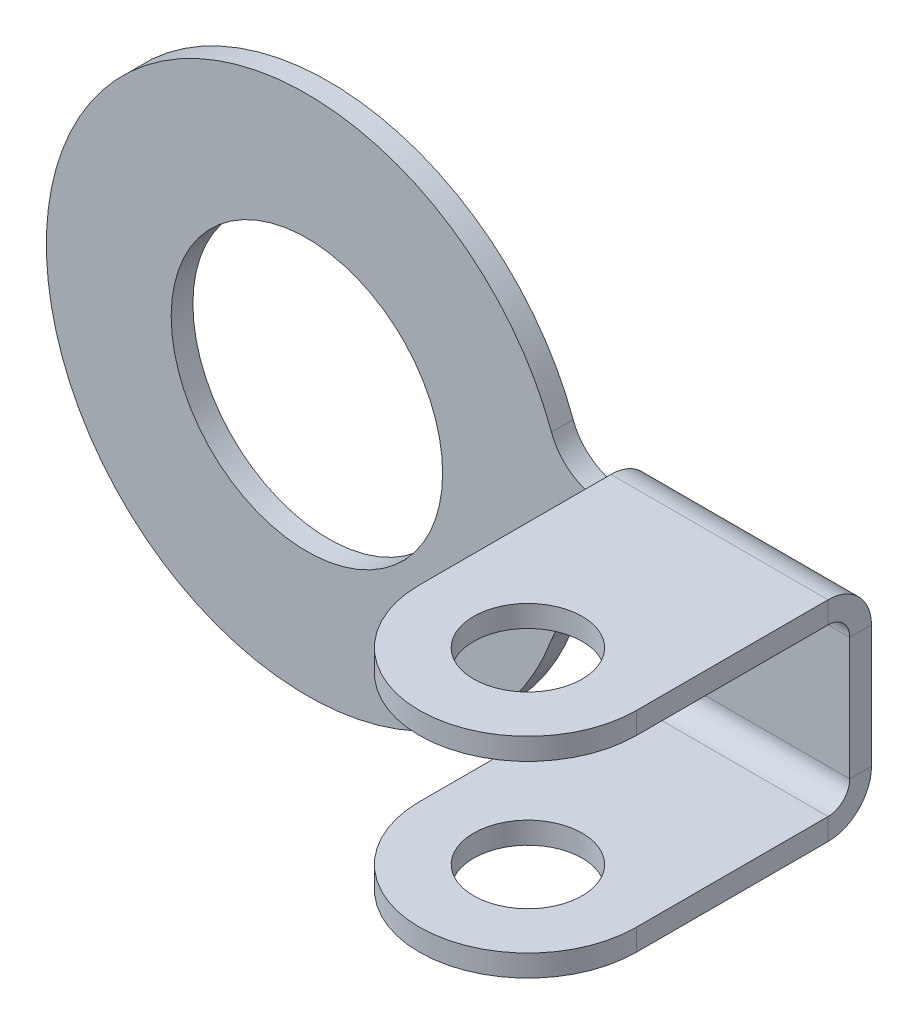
ISO-10303-21;
HEADER;
FILE_DESCRIPTION(('STEP AP214'),'2;1');
FILE_NAME('part.step','',(''),(''),'','','');
FILE_SCHEMA(('AUTOMOTIVE_DESIGN { 1 0 10303 214 1 1 1 1 }'));
ENDSEC;
DATA;
#1=APPLICATION_CONTEXT('core data for automotive mechanical design processes');
#2=APPLICATION_PROTOCOL_DEFINITION('international standard','automotive_design',2000,#1);
#3=PRODUCT_CONTEXT('',#1,'mechanical');
#4=PRODUCT('Part','Part','',(#3));
#5=PRODUCT_RELATED_PRODUCT_CATEGORY('part','',(#4));
#6=PRODUCT_DEFINITION_FORMATION('','',#4);
#7=PRODUCT_DEFINITION_CONTEXT('part definition',#1,'design');
#8=PRODUCT_DEFINITION('design','',#6,#7);
#9=PRODUCT_DEFINITION_SHAPE('','',#8);
#10=(LENGTH_UNIT() NAMED_UNIT(*) SI_UNIT(.MILLI.,.METRE.));
#11=(NAMED_UNIT(*) PLANE_ANGLE_UNIT() SI_UNIT($,.RADIAN.));
#12=(NAMED_UNIT(*) SI_UNIT($,.STERADIAN.) SOLID_ANGLE_UNIT());
#13=UNCERTAINTY_MEASURE_WITH_UNIT(LENGTH_MEASURE(1.E-05),#10,'distance_accuracy_value','');
#14=(GEOMETRIC_REPRESENTATION_CONTEXT(3) GLOBAL_UNCERTAINTY_ASSIGNED_CONTEXT((#13)) GLOBAL_UNIT_ASSIGNED_CONTEXT((#10,
#11,#12)) REPRESENTATION_CONTEXT('',''));
#15=CARTESIAN_POINT('',(0.,0.,0.));
#16=DIRECTION('',(0.,0.,1.));
#17=DIRECTION('',(1.,0.,0.));
#18=AXIS2_PLACEMENT_3D('',#15,#16,#17);
#19=CARTESIAN_POINT('',(17.2213151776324,15.3561944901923,-18.3561944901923));
#20=DIRECTION('',(0.,1.,0.));
#21=DIRECTION('',(1.,0.,0.));
#22=AXIS2_PLACEMENT_3D('',#19,#20,#21);
#23=PLANE('',#22);
#24=CARTESIAN_POINT('',(30.,15.3561944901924,19.6438055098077));
#25=DIRECTION('',(0.,1.,0.));
#26=DIRECTION('',(-1.,0.,0.));
#27=AXIS2_PLACEMENT_3D('',#24,#25,#26);
#28=CIRCLE('',#27,5.);
#29=CARTESIAN_POINT('',(25.,15.3561944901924,19.6438055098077));
#30=VERTEX_POINT('',#29);
#31=EDGE_CURVE('E112',#30,#30,#28,.T.);
#32=ORIENTED_EDGE('',*,*,#31,.F.);
#33=EDGE_LOOP('',(#32));
#34=FACE_BOUND('',#33,.T.);
#35=DIRECTION('',(0.,0.,-1.));
#36=VECTOR('',#35,1.);
#37=CARTESIAN_POINT('',(40.,15.3561944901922,-36.3561944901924));
#38=LINE('',#37,#36);
#39=CARTESIAN_POINT('',(40.,15.3561944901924,19.6438055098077));
#40=VERTEX_POINT('',#39);
#41=CARTESIAN_POINT('',(39.9999999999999,15.3561944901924,2.));
#42=VERTEX_POINT('',#41);
#43=EDGE_CURVE('E78',#40,#42,#38,.T.);
#44=ORIENTED_EDGE('',*,*,#43,.T.);
#45=DIRECTION('',(-1.,0.,0.));
#46=VECTOR('',#45,1.);
#47=CARTESIAN_POINT('',(17.2213151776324,15.3561944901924,2.00000000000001));
#48=LINE('',#47,#46);
#49=CARTESIAN_POINT('',(20.,15.3561944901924,2.00000000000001));
#50=VERTEX_POINT('',#49);
#51=EDGE_CURVE('E11',#42,#50,#48,.T.);
#52=ORIENTED_EDGE('',*,*,#51,.T.);
#53=DIRECTION('',(0.,0.,1.));
#54=VECTOR('',#53,1.);
#55=CARTESIAN_POINT('',(20.,15.3561944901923,-2.35619449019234));
#56=LINE('',#55,#54);
#57=CARTESIAN_POINT('',(20.,15.3561944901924,19.6438055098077));
#58=VERTEX_POINT('',#57);
#59=EDGE_CURVE('E87',#50,#58,#56,.T.);
#60=ORIENTED_EDGE('',*,*,#59,.T.);
#61=CARTESIAN_POINT('',(30.,15.3561944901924,19.6438055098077));
#62=DIRECTION('',(0.,1.,0.));
#63=DIRECTION('',(1.,0.,0.));
#64=AXIS2_PLACEMENT_3D('',#61,#62,#63);
#65=CIRCLE('',#64,10.);
#66=EDGE_CURVE('E71',#58,#40,#65,.T.);
#67=ORIENTED_EDGE('',*,*,#66,.T.);
#68=EDGE_LOOP('',(#44,#52,#60,#67));
#69=FACE_BOUND('',#68,.T.);
#70=ADVANCED_FACE('F31',(#34,#69),#23,.T.);
#71=CARTESIAN_POINT('',(20.,13.3561944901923,-2.35619449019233));
#72=DIRECTION('',(-1.,0.,0.));
#73=DIRECTION('',(0.,1.,0.));
#74=AXIS2_PLACEMENT_3D('',#71,#72,#73);
#75=PLANE('',#74);
#76=ORIENTED_EDGE('',*,*,#59,.F.);
#77=DIRECTION('',(0.,-1.,0.));
#78=VECTOR('',#77,1.);
#79=CARTESIAN_POINT('',(20.,13.3561944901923,2.));
#80=LINE('',#79,#78);
#81=CARTESIAN_POINT('',(20.,13.3561944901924,2.00000000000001));
#82=VERTEX_POINT('',#81);
#83=EDGE_CURVE('E39',#50,#82,#80,.T.);
#84=ORIENTED_EDGE('',*,*,#83,.T.);
#85=DIRECTION('',(0.,0.,1.));
#86=VECTOR('',#85,1.);
#87=CARTESIAN_POINT('',(20.,13.3561944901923,-2.35619449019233));
#88=LINE('',#87,#86);
#89=CARTESIAN_POINT('',(20.,13.3561944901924,19.6438055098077));
#90=VERTEX_POINT('',#89);
#91=EDGE_CURVE('E84',#82,#90,#88,.T.);
#92=ORIENTED_EDGE('',*,*,#91,.T.);
#93=DIRECTION('',(0.,1.,0.));
#94=VECTOR('',#93,1.);
#95=CARTESIAN_POINT('',(20.,13.3561944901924,19.6438055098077));
#96=LINE('',#95,#94);
#97=EDGE_CURVE('E74',#90,#58,#96,.T.);
#98=ORIENTED_EDGE('',*,*,#97,.T.);
#99=EDGE_LOOP('',(#76,#84,#92,#98));
#100=FACE_BOUND('',#99,.T.);
#101=ADVANCED_FACE('F33',(#100),#75,.T.);
#102=CARTESIAN_POINT('',(40.,13.3561944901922,-36.3561944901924));
#103=DIRECTION('',(1.,0.,0.));
#104=DIRECTION('',(0.,-1.,0.));
#105=AXIS2_PLACEMENT_3D('',#102,#103,#104);
#106=PLANE('',#105);
#107=DIRECTION('',(0.,0.,-1.));
#108=VECTOR('',#107,1.);
#109=CARTESIAN_POINT('',(40.,13.3561944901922,-36.3561944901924));
#110=LINE('',#109,#108);
#111=CARTESIAN_POINT('',(40.,13.3561944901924,19.6438055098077));
#112=VERTEX_POINT('',#111);
#113=CARTESIAN_POINT('',(39.9999999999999,13.3561944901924,2.00000000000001));
#114=VERTEX_POINT('',#113);
#115=EDGE_CURVE('E95',#112,#114,#110,.T.);
#116=ORIENTED_EDGE('',*,*,#115,.T.);
#117=DIRECTION('',(0.,1.,0.));
#118=VECTOR('',#117,1.);
#119=CARTESIAN_POINT('',(40.,13.3561944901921,2.));
#120=LINE('',#119,#118);
#121=EDGE_CURVE('E82',#114,#42,#120,.T.);
#122=ORIENTED_EDGE('',*,*,#121,.T.);
#123=ORIENTED_EDGE('',*,*,#43,.F.);
#124=DIRECTION('',(0.,1.,0.));
#125=VECTOR('',#124,1.);
#126=CARTESIAN_POINT('',(40.,13.3561944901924,19.6438055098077));
#127=LINE('',#126,#125);
#128=EDGE_CURVE('E55',#112,#40,#127,.T.);
#129=ORIENTED_EDGE('',*,*,#128,.F.);
#130=EDGE_LOOP('',(#116,#122,#123,#129));
#131=FACE_BOUND('',#130,.T.);
#132=ADVANCED_FACE('F79',(#131),#106,.T.);
#133=CARTESIAN_POINT('',(17.2213151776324,13.3561944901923,-18.3561944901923));
#134=DIRECTION('',(0.,1.,0.));
#135=DIRECTION('',(1.,0.,0.));
#136=AXIS2_PLACEMENT_3D('',#133,#134,#135);
#137=PLANE('',#136);
#138=DIRECTION('',(-1.,0.,0.));
#139=VECTOR('',#138,1.);
#140=CARTESIAN_POINT('',(17.2213151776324,13.3561944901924,2.));
#141=LINE('',#140,#139);
#142=EDGE_CURVE('E46',#114,#82,#141,.T.);
#143=ORIENTED_EDGE('',*,*,#142,.F.);
#144=ORIENTED_EDGE('',*,*,#115,.F.);
#145=CARTESIAN_POINT('',(30.,13.3561944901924,19.6438055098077));
#146=DIRECTION('',(0.,1.,0.));
#147=DIRECTION('',(1.,0.,0.));
#148=AXIS2_PLACEMENT_3D('',#145,#146,#147);
#149=CIRCLE('',#148,10.);
#150=EDGE_CURVE('E73',#90,#112,#149,.T.);
#151=ORIENTED_EDGE('',*,*,#150,.F.);
#152=ORIENTED_EDGE('',*,*,#91,.F.);
#153=EDGE_LOOP('',(#143,#144,#151,#152));
#154=FACE_BOUND('',#153,.T.);
#155=CARTESIAN_POINT('',(30.,13.3561944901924,19.6438055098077));
#156=DIRECTION('',(0.,1.,0.));
#157=DIRECTION('',(-1.,0.,0.));
#158=AXIS2_PLACEMENT_3D('',#155,#156,#157);
#159=CIRCLE('',#158,5.);
#160=CARTESIAN_POINT('',(25.,13.3561944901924,19.6438055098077));
#161=VERTEX_POINT('',#160);
#162=EDGE_CURVE('E90',#161,#161,#159,.T.);
#163=ORIENTED_EDGE('',*,*,#162,.T.);
#164=EDGE_LOOP('',(#163));
#165=FACE_BOUND('',#164,.T.);
#166=ADVANCED_FACE('F106',(#154,#165),#137,.F.);
#167=CARTESIAN_POINT('',(30.,13.3561944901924,19.6438055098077));
#168=DIRECTION('',(0.,1.,0.));
#169=DIRECTION('',(1.,0.,0.));
#170=AXIS2_PLACEMENT_3D('',#167,#168,#169);
#171=CYLINDRICAL_SURFACE('',#170,10.);
#172=ORIENTED_EDGE('',*,*,#66,.F.);
#173=ORIENTED_EDGE('',*,*,#97,.F.);
#174=ORIENTED_EDGE('',*,*,#150,.T.);
#175=ORIENTED_EDGE('',*,*,#128,.T.);
#176=EDGE_LOOP('',(#172,#173,#174,#175));
#177=FACE_BOUND('',#176,.T.);
#178=ADVANCED_FACE('F68',(#177),#171,.T.);
#179=CARTESIAN_POINT('',(30.,13.3561944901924,19.6438055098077));
#180=DIRECTION('',(0.,1.,0.));
#181=DIRECTION('',(1.,0.,0.));
#182=AXIS2_PLACEMENT_3D('',#179,#180,#181);
#183=CYLINDRICAL_SURFACE('',#182,5.);
#184=ORIENTED_EDGE('',*,*,#162,.F.);
#185=EDGE_LOOP('',(#184));
#186=FACE_BOUND('',#185,.T.);
#187=ORIENTED_EDGE('',*,*,#31,.T.);
#188=EDGE_LOOP('',(#187));
#189=FACE_BOUND('',#188,.T.);
#190=ADVANCED_FACE('F347',(#186,#189),#183,.F.);
#191=CARTESIAN_POINT('',(17.2213151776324,30.6438055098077,1.64380550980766));
#192=DIRECTION('',(0.,-1.,0.));
#193=DIRECTION('',(1.,0.,0.));
#194=AXIS2_PLACEMENT_3D('',#191,#192,#193);
#195=PLANE('',#194);
#196=CARTESIAN_POINT('',(30.,30.6438055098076,19.6438055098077));
#197=DIRECTION('',(0.,-1.,0.));
#198=DIRECTION('',(1.,0.,0.));
#199=AXIS2_PLACEMENT_3D('',#196,#197,#198);
#200=CIRCLE('',#199,5.);
#201=CARTESIAN_POINT('',(35.,30.6438055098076,19.6438055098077));
#202=VERTEX_POINT('',#201);
#203=EDGE_CURVE('E265',#202,#202,#200,.T.);
#204=ORIENTED_EDGE('',*,*,#203,.F.);
#205=EDGE_LOOP('',(#204));
#206=FACE_BOUND('',#205,.T.);
#207=DIRECTION('',(0.,0.,-1.));
#208=VECTOR('',#207,1.);
#209=CARTESIAN_POINT('',(20.,30.6438055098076,19.6438055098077));
#210=LINE('',#209,#208);
#211=CARTESIAN_POINT('',(20.,30.6438055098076,19.6438055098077));
#212=VERTEX_POINT('',#211);
#213=CARTESIAN_POINT('',(20.,30.6438055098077,2.00000000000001));
#214=VERTEX_POINT('',#213);
#215=EDGE_CURVE('E257',#212,#214,#210,.T.);
#216=ORIENTED_EDGE('',*,*,#215,.T.);
#217=DIRECTION('',(1.,0.,0.));
#218=VECTOR('',#217,1.);
#219=CARTESIAN_POINT('',(17.2213151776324,30.6438055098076,2.00000000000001));
#220=LINE('',#219,#218);
#221=CARTESIAN_POINT('',(40.,30.6438055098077,2.00000000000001));
#222=VERTEX_POINT('',#221);
#223=EDGE_CURVE('E241',#214,#222,#220,.T.);
#224=ORIENTED_EDGE('',*,*,#223,.T.);
#225=DIRECTION('',(0.,0.,1.));
#226=VECTOR('',#225,1.);
#227=CARTESIAN_POINT('',(40.,30.6438055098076,19.6438055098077));
#228=LINE('',#227,#226);
#229=CARTESIAN_POINT('',(40.,30.6438055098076,19.6438055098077));
#230=VERTEX_POINT('',#229);
#231=EDGE_CURVE('E249',#222,#230,#228,.T.);
#232=ORIENTED_EDGE('',*,*,#231,.T.);
#233=CARTESIAN_POINT('',(30.,30.6438055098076,19.6438055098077));
#234=DIRECTION('',(0.,-1.,0.));
#235=DIRECTION('',(-1.,0.,0.));
#236=AXIS2_PLACEMENT_3D('',#233,#234,#235);
#237=CIRCLE('',#236,10.);
#238=EDGE_CURVE('E262',#230,#212,#237,.T.);
#239=ORIENTED_EDGE('',*,*,#238,.T.);
#240=EDGE_LOOP('',(#216,#224,#232,#239));
#241=FACE_BOUND('',#240,.T.);
#242=ADVANCED_FACE('F344',(#206,#241),#195,.T.);
#243=CARTESIAN_POINT('',(40.,32.6438055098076,19.6438055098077));
#244=DIRECTION('',(1.,0.,0.));
#245=DIRECTION('',(0.,1.,0.));
#246=AXIS2_PLACEMENT_3D('',#243,#244,#245);
#247=PLANE('',#246);
#248=ORIENTED_EDGE('',*,*,#231,.F.);
#249=DIRECTION('',(0.,1.,0.));
#250=VECTOR('',#249,1.);
#251=CARTESIAN_POINT('',(40.,32.6438055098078,2.00000000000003));
#252=LINE('',#251,#250);
#253=CARTESIAN_POINT('',(40.,32.6438055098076,2.00000000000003));
#254=VERTEX_POINT('',#253);
#255=EDGE_CURVE('E222',#222,#254,#252,.T.);
#256=ORIENTED_EDGE('',*,*,#255,.T.);
#257=DIRECTION('',(0.,0.,1.));
#258=VECTOR('',#257,1.);
#259=CARTESIAN_POINT('',(40.,32.6438055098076,19.6438055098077));
#260=LINE('',#259,#258);
#261=CARTESIAN_POINT('',(40.,32.6438055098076,19.6438055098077));
#262=VERTEX_POINT('',#261);
#263=EDGE_CURVE('E247',#254,#262,#260,.T.);
#264=ORIENTED_EDGE('',*,*,#263,.T.);
#265=DIRECTION('',(0.,-1.,0.));
#266=VECTOR('',#265,1.);
#267=CARTESIAN_POINT('',(40.,32.6438055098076,19.6438055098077));
#268=LINE('',#267,#266);
#269=EDGE_CURVE('E269',#262,#230,#268,.T.);
#270=ORIENTED_EDGE('',*,*,#269,.T.);
#271=EDGE_LOOP('',(#248,#256,#264,#270));
#272=FACE_BOUND('',#271,.T.);
#273=ADVANCED_FACE('F245',(#272),#247,.T.);
#274=CARTESIAN_POINT('',(20.,32.6438055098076,19.6438055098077));
#275=DIRECTION('',(-1.,0.,0.));
#276=DIRECTION('',(0.,0.,-1.));
#277=AXIS2_PLACEMENT_3D('',#274,#275,#276);
#278=PLANE('',#277);
#279=DIRECTION('',(0.,0.,-1.));
#280=VECTOR('',#279,1.);
#281=CARTESIAN_POINT('',(20.,32.6438055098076,19.6438055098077));
#282=LINE('',#281,#280);
#283=CARTESIAN_POINT('',(20.,32.6438055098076,19.6438055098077));
#284=VERTEX_POINT('',#283);
#285=CARTESIAN_POINT('',(20.,32.6438055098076,2.00000000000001));
#286=VERTEX_POINT('',#285);
#287=EDGE_CURVE('E259',#284,#286,#282,.T.);
#288=ORIENTED_EDGE('',*,*,#287,.T.);
#289=DIRECTION('',(0.,-1.,0.));
#290=VECTOR('',#289,1.);
#291=CARTESIAN_POINT('',(20.,32.6438055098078,2.00000000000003));
#292=LINE('',#291,#290);
#293=EDGE_CURVE('E250',#286,#214,#292,.T.);
#294=ORIENTED_EDGE('',*,*,#293,.T.);
#295=ORIENTED_EDGE('',*,*,#215,.F.);
#296=DIRECTION('',(0.,-1.,0.));
#297=VECTOR('',#296,1.);
#298=CARTESIAN_POINT('',(20.,32.6438055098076,19.6438055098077));
#299=LINE('',#298,#297);
#300=EDGE_CURVE('E274',#284,#212,#299,.T.);
#301=ORIENTED_EDGE('',*,*,#300,.F.);
#302=EDGE_LOOP('',(#288,#294,#295,#301));
#303=FACE_BOUND('',#302,.T.);
#304=ADVANCED_FACE('F349',(#303),#278,.T.);
#305=CARTESIAN_POINT('',(30.,32.6438055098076,19.6438055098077));
#306=DIRECTION('',(0.,-1.,0.));
#307=DIRECTION('',(1.,0.,0.));
#308=AXIS2_PLACEMENT_3D('',#305,#306,#307);
#309=CYLINDRICAL_SURFACE('',#308,10.);
#310=ORIENTED_EDGE('',*,*,#238,.F.);
#311=ORIENTED_EDGE('',*,*,#269,.F.);
#312=CARTESIAN_POINT('',(30.,32.6438055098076,19.6438055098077));
#313=DIRECTION('',(0.,-1.,0.));
#314=DIRECTION('',(-1.,0.,0.));
#315=AXIS2_PLACEMENT_3D('',#312,#313,#314);
#316=CIRCLE('',#315,10.);
#317=EDGE_CURVE('E256',#262,#284,#316,.T.);
#318=ORIENTED_EDGE('',*,*,#317,.T.);
#319=ORIENTED_EDGE('',*,*,#300,.T.);
#320=EDGE_LOOP('',(#310,#311,#318,#319));
#321=FACE_BOUND('',#320,.T.);
#322=ADVANCED_FACE('F343',(#321),#309,.T.);
#323=CARTESIAN_POINT('',(17.2213151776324,32.6438055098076,1.64380550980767));
#324=DIRECTION('',(0.,-1.,0.));
#325=DIRECTION('',(1.,0.,0.));
#326=AXIS2_PLACEMENT_3D('',#323,#324,#325);
#327=PLANE('',#326);
#328=DIRECTION('',(1.,0.,0.));
#329=VECTOR('',#328,1.);
#330=CARTESIAN_POINT('',(17.2213151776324,32.6438055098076,2.00000000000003));
#331=LINE('',#330,#329);
#332=EDGE_CURVE('E233',#286,#254,#331,.T.);
#333=ORIENTED_EDGE('',*,*,#332,.F.);
#334=ORIENTED_EDGE('',*,*,#287,.F.);
#335=ORIENTED_EDGE('',*,*,#317,.F.);
#336=ORIENTED_EDGE('',*,*,#263,.F.);
#337=EDGE_LOOP('',(#333,#334,#335,#336));
#338=FACE_BOUND('',#337,.T.);
#339=CARTESIAN_POINT('',(30.,32.6438055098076,19.6438055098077));
#340=DIRECTION('',(0.,-1.,0.));
#341=DIRECTION('',(1.,0.,0.));
#342=AXIS2_PLACEMENT_3D('',#339,#340,#341);
#343=CIRCLE('',#342,5.);
#344=CARTESIAN_POINT('',(35.,32.6438055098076,19.6438055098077));
#345=VERTEX_POINT('',#344);
#346=EDGE_CURVE('E271',#345,#345,#343,.T.);
#347=ORIENTED_EDGE('',*,*,#346,.T.);
#348=EDGE_LOOP('',(#347));
#349=FACE_BOUND('',#348,.T.);
#350=ADVANCED_FACE('F253',(#338,#349),#327,.F.);
#351=CARTESIAN_POINT('',(30.,32.6438055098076,19.6438055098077));
#352=DIRECTION('',(0.,-1.,0.));
#353=DIRECTION('',(1.,0.,0.));
#354=AXIS2_PLACEMENT_3D('',#351,#352,#353);
#355=CYLINDRICAL_SURFACE('',#354,5.);
#356=ORIENTED_EDGE('',*,*,#346,.F.);
#357=EDGE_LOOP('',(#356));
#358=FACE_BOUND('',#357,.T.);
#359=ORIENTED_EDGE('',*,*,#203,.T.);
#360=EDGE_LOOP('',(#359));
#361=FACE_BOUND('',#360,.T.);
#362=ADVANCED_FACE('F337',(#358,#361),#355,.F.);
#363=CARTESIAN_POINT('',(17.2213151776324,33.,-2.));
#364=DIRECTION('',(0.,0.,1.));
#365=DIRECTION('',(1.,0.,0.));
#366=AXIS2_PLACEMENT_3D('',#363,#364,#365);
#367=PLANE('',#366);
#368=CARTESIAN_POINT('',(-10.,23.,-2.));
#369=DIRECTION('',(0.,0.,1.));
#370=DIRECTION('',(1.,0.,0.));
#371=AXIS2_PLACEMENT_3D('',#368,#369,#370);
#372=CIRCLE('',#371,12.5);
#373=CARTESIAN_POINT('',(2.49999999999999,23.,-2.));
#374=VERTEX_POINT('',#373);
#375=EDGE_CURVE('E744',#374,#374,#372,.T.);
#376=ORIENTED_EDGE('',*,*,#375,.T.);
#377=EDGE_LOOP('',(#376));
#378=FACE_BOUND('',#377,.T.);
#379=DIRECTION('',(0.,1.,0.));
#380=VECTOR('',#379,1.);
#381=CARTESIAN_POINT('',(40.,51.,-2.));
#382=LINE('',#381,#380);
#383=CARTESIAN_POINT('',(40.,17.3561944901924,-2.));
#384=VERTEX_POINT('',#383);
#385=CARTESIAN_POINT('',(40.,28.6438055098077,-2.));
#386=VERTEX_POINT('',#385);
#387=EDGE_CURVE('E290',#384,#386,#382,.T.);
#388=ORIENTED_EDGE('',*,*,#387,.F.);
#389=DIRECTION('',(-1.,0.,0.));
#390=VECTOR('',#389,1.);
#391=CARTESIAN_POINT('',(17.2213151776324,17.3561944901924,-2.));
#392=LINE('',#391,#390);
#393=CARTESIAN_POINT('',(19.9344118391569,17.3561944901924,-2.));
#394=VERTEX_POINT('',#393);
#395=EDGE_CURVE('E281',#384,#394,#392,.T.);
#396=ORIENTED_EDGE('',*,*,#395,.T.);
#397=CARTESIAN_POINT('',(19.,17.,-2.));
#398=DIRECTION('',(0.,0.,-1.));
#399=DIRECTION('',(-1.,0.,0.));
#400=AXIS2_PLACEMENT_3D('',#397,#398,#399);
#401=CIRCLE('',#400,1.);
#402=CARTESIAN_POINT('',(19.,18.,-2.));
#403=VERTEX_POINT('',#402);
#404=EDGE_CURVE('E287',#403,#394,#401,.T.);
#405=ORIENTED_EDGE('',*,*,#404,.F.);
#406=DIRECTION('',(1.,0.,0.));
#407=VECTOR('',#406,1.);
#408=CARTESIAN_POINT('',(17.2213151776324,18.,-2.));
#409=LINE('',#408,#407);
#410=CARTESIAN_POINT('',(17.2213151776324,18.,-2.));
#411=VERTEX_POINT('',#410);
#412=EDGE_CURVE('E291',#411,#403,#409,.T.);
#413=ORIENTED_EDGE('',*,*,#412,.F.);
#414=CARTESIAN_POINT('',(17.2213151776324,13.,-2.));
#415=DIRECTION('',(0.,0.,-1.));
#416=DIRECTION('',(-1.,0.,0.));
#417=AXIS2_PLACEMENT_3D('',#414,#415,#416);
#418=CIRCLE('',#417,5.);
#419=CARTESIAN_POINT('',(12.5279849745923,14.7241379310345,-2.));
#420=VERTEX_POINT('',#419);
#421=EDGE_CURVE('E764',#420,#411,#418,.T.);
#422=ORIENTED_EDGE('',*,*,#421,.F.);
#423=CARTESIAN_POINT('',(-10.,23.,-2.));
#424=DIRECTION('',(0.,0.,1.));
#425=DIRECTION('',(1.,0.,0.));
#426=AXIS2_PLACEMENT_3D('',#423,#424,#425);
#427=CIRCLE('',#426,24.);
#428=CARTESIAN_POINT('',(12.5279849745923,31.2758620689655,-2.));
#429=VERTEX_POINT('',#428);
#430=EDGE_CURVE('E760',#429,#420,#427,.T.);
#431=ORIENTED_EDGE('',*,*,#430,.F.);
#432=CARTESIAN_POINT('',(17.2213151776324,33.,-2.));
#433=DIRECTION('',(0.,0.,-1.));
#434=DIRECTION('',(1.,0.,0.));
#435=AXIS2_PLACEMENT_3D('',#432,#433,#434);
#436=CIRCLE('',#435,5.);
#437=CARTESIAN_POINT('',(17.2213151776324,28.,-2.));
#438=VERTEX_POINT('',#437);
#439=EDGE_CURVE('E757',#438,#429,#436,.T.);
#440=ORIENTED_EDGE('',*,*,#439,.F.);
#441=DIRECTION('',(-1.,0.,0.));
#442=VECTOR('',#441,1.);
#443=CARTESIAN_POINT('',(17.2213151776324,28.,-2.));
#444=LINE('',#443,#442);
#445=CARTESIAN_POINT('',(19.,28.,-2.));
#446=VERTEX_POINT('',#445);
#447=EDGE_CURVE('E771',#446,#438,#444,.T.);
#448=ORIENTED_EDGE('',*,*,#447,.F.);
#449=CARTESIAN_POINT('',(19.,29.,-2.));
#450=DIRECTION('',(0.,0.,-1.));
#451=DIRECTION('',(1.,0.,0.));
#452=AXIS2_PLACEMENT_3D('',#449,#450,#451);
#453=CIRCLE('',#452,1.);
#454=CARTESIAN_POINT('',(19.9344118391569,28.6438055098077,-2.));
#455=VERTEX_POINT('',#454);
#456=EDGE_CURVE('E770',#455,#446,#453,.T.);
#457=ORIENTED_EDGE('',*,*,#456,.F.);
#458=DIRECTION('',(1.,0.,0.));
#459=VECTOR('',#458,1.);
#460=CARTESIAN_POINT('',(17.2213151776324,28.6438055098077,-2.));
#461=LINE('',#460,#459);
#462=EDGE_CURVE('E794',#455,#386,#461,.T.);
#463=ORIENTED_EDGE('',*,*,#462,.T.);
#464=EDGE_LOOP('',(#388,#396,#405,#413,#422,#431,#440,#448,#457,#463));
#465=FACE_BOUND('',#464,.T.);
#466=ADVANCED_FACE('F335',(#378,#465),#367,.F.);
#467=CARTESIAN_POINT('',(17.2213151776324,33.,-2.));
#468=DIRECTION('',(0.,0.,1.));
#469=DIRECTION('',(1.,0.,0.));
#470=AXIS2_PLACEMENT_3D('',#467,#468,#469);
#471=CYLINDRICAL_SURFACE('',#470,5.);
#472=CARTESIAN_POINT('',(17.2213151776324,33.,0.));
#473=DIRECTION('',(0.,0.,-1.));
#474=DIRECTION('',(1.,0.,0.));
#475=AXIS2_PLACEMENT_3D('',#472,#473,#474);
#476=CIRCLE('',#475,5.);
#477=CARTESIAN_POINT('',(17.2213151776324,28.,0.));
#478=VERTEX_POINT('',#477);
#479=CARTESIAN_POINT('',(12.5279849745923,31.2758620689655,0.));
#480=VERTEX_POINT('',#479);
#481=EDGE_CURVE('E752',#478,#480,#476,.T.);
#482=ORIENTED_EDGE('',*,*,#481,.F.);
#483=DIRECTION('',(0.,0.,1.));
#484=VECTOR('',#483,1.);
#485=CARTESIAN_POINT('',(17.2213151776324,28.,-2.));
#486=LINE('',#485,#484);
#487=EDGE_CURVE('E792',#438,#478,#486,.T.);
#488=ORIENTED_EDGE('',*,*,#487,.F.);
#489=ORIENTED_EDGE('',*,*,#439,.T.);
#490=DIRECTION('',(0.,0.,1.));
#491=VECTOR('',#490,1.);
#492=CARTESIAN_POINT('',(12.5279849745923,31.2758620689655,-2.));
#493=LINE('',#492,#491);
#494=EDGE_CURVE('E774',#429,#480,#493,.T.);
#495=ORIENTED_EDGE('',*,*,#494,.T.);
#496=EDGE_LOOP('',(#482,#488,#489,#495));
#497=FACE_BOUND('',#496,.T.);
#498=ADVANCED_FACE('F331',(#497),#471,.F.);
#499=CARTESIAN_POINT('',(17.2213151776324,28.,-2.));
#500=DIRECTION('',(0.,1.,0.));
#501=DIRECTION('',(0.,0.,1.));
#502=AXIS2_PLACEMENT_3D('',#499,#500,#501);
#503=PLANE('',#502);
#504=DIRECTION('',(-1.,0.,0.));
#505=VECTOR('',#504,1.);
#506=CARTESIAN_POINT('',(17.2213151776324,28.,0.));
#507=LINE('',#506,#505);
#508=CARTESIAN_POINT('',(19.,28.,0.));
#509=VERTEX_POINT('',#508);
#510=EDGE_CURVE('E761',#509,#478,#507,.T.);
#511=ORIENTED_EDGE('',*,*,#510,.F.);
#512=DIRECTION('',(0.,0.,1.));
#513=VECTOR('',#512,1.);
#514=CARTESIAN_POINT('',(19.,28.,-2.));
#515=LINE('',#514,#513);
#516=EDGE_CURVE('E795',#446,#509,#515,.T.);
#517=ORIENTED_EDGE('',*,*,#516,.F.);
#518=ORIENTED_EDGE('',*,*,#447,.T.);
#519=ORIENTED_EDGE('',*,*,#487,.T.);
#520=EDGE_LOOP('',(#511,#517,#518,#519));
#521=FACE_BOUND('',#520,.T.);
#522=ADVANCED_FACE('F334',(#521),#503,.T.);
#523=CARTESIAN_POINT('',(19.,29.,-2.));
#524=DIRECTION('',(0.,0.,1.));
#525=DIRECTION('',(1.,0.,0.));
#526=AXIS2_PLACEMENT_3D('',#523,#524,#525);
#527=CYLINDRICAL_SURFACE('',#526,1.);
#528=CARTESIAN_POINT('',(19.9344118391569,28.6438055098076,-2.));
#529=CARTESIAN_POINT('',(19.9344118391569,28.6438055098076,0.));
#530=B_SPLINE_CURVE_WITH_KNOTS('',1,(#528,#529),.UNSPECIFIED.,.F.,.F.,(2,2),(0.,1.),.UNSPECIFIED.);
#531=CARTESIAN_POINT('',(19.9344118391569,28.6438055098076,0.));
#532=VERTEX_POINT('',#531);
#533=EDGE_CURVE('E739',#455,#532,#530,.T.);
#534=ORIENTED_EDGE('',*,*,#533,.F.);
#535=ORIENTED_EDGE('',*,*,#456,.T.);
#536=ORIENTED_EDGE('',*,*,#516,.T.);
#537=CARTESIAN_POINT('',(19.,29.,0.));
#538=DIRECTION('',(0.,0.,-1.));
#539=DIRECTION('',(1.,0.,0.));
#540=AXIS2_PLACEMENT_3D('',#537,#538,#539);
#541=CIRCLE('',#540,1.);
#542=EDGE_CURVE('E789',#532,#509,#541,.T.);
#543=ORIENTED_EDGE('',*,*,#542,.F.);
#544=EDGE_LOOP('',(#534,#535,#536,#543));
#545=FACE_BOUND('',#544,.T.);
#546=ADVANCED_FACE('F417',(#545),#527,.F.);
#547=CARTESIAN_POINT('',(40.,51.,-2.));
#548=DIRECTION('',(1.,0.,0.));
#549=DIRECTION('',(0.,0.,-1.));
#550=AXIS2_PLACEMENT_3D('',#547,#548,#549);
#551=PLANE('',#550);
#552=DIRECTION('',(0.,0.,1.));
#553=VECTOR('',#552,1.);
#554=CARTESIAN_POINT('',(40.,17.3561944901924,-2.00000000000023));
#555=LINE('',#554,#553);
#556=CARTESIAN_POINT('',(39.9999999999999,17.3561944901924,0.));
#557=VERTEX_POINT('',#556);
#558=EDGE_CURVE('E283',#384,#557,#555,.T.);
#559=ORIENTED_EDGE('',*,*,#558,.F.);
#560=ORIENTED_EDGE('',*,*,#387,.T.);
#561=DIRECTION('',(0.,0.,-1.));
#562=VECTOR('',#561,1.);
#563=CARTESIAN_POINT('',(40.,28.6438055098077,-2.00000000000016));
#564=LINE('',#563,#562);
#565=CARTESIAN_POINT('',(40.,28.6438055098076,0.));
#566=VERTEX_POINT('',#565);
#567=EDGE_CURVE('E225',#566,#386,#564,.T.);
#568=ORIENTED_EDGE('',*,*,#567,.F.);
#569=DIRECTION('',(0.,1.,0.));
#570=VECTOR('',#569,1.);
#571=CARTESIAN_POINT('',(40.,51.,0.));
#572=LINE('',#571,#570);
#573=EDGE_CURVE('E787',#557,#566,#572,.T.);
#574=ORIENTED_EDGE('',*,*,#573,.F.);
#575=EDGE_LOOP('',(#559,#560,#568,#574));
#576=FACE_BOUND('',#575,.T.);
#577=ADVANCED_FACE('F317',(#576),#551,.T.);
#578=CARTESIAN_POINT('',(19.,17.,-2.));
#579=DIRECTION('',(0.,0.,1.));
#580=DIRECTION('',(1.,0.,0.));
#581=AXIS2_PLACEMENT_3D('',#578,#579,#580);
#582=CYLINDRICAL_SURFACE('',#581,1.);
#583=CARTESIAN_POINT('',(19.9344118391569,17.3561944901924,0.));
#584=CARTESIAN_POINT('',(19.9344118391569,17.3561944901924,-2.));
#585=B_SPLINE_CURVE_WITH_KNOTS('',1,(#583,#584),.UNSPECIFIED.,.F.,.F.,(2,2),(0.,1.),.UNSPECIFIED.);
#586=CARTESIAN_POINT('',(19.9344118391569,17.3561944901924,0.));
#587=VERTEX_POINT('',#586);
#588=EDGE_CURVE('E298',#587,#394,#585,.T.);
#589=ORIENTED_EDGE('',*,*,#588,.F.);
#590=CARTESIAN_POINT('',(19.,17.,0.));
#591=DIRECTION('',(0.,0.,-1.));
#592=DIRECTION('',(-1.,0.,0.));
#593=AXIS2_PLACEMENT_3D('',#590,#591,#592);
#594=CIRCLE('',#593,1.);
#595=CARTESIAN_POINT('',(19.,18.,0.));
#596=VERTEX_POINT('',#595);
#597=EDGE_CURVE('E786',#596,#587,#594,.T.);
#598=ORIENTED_EDGE('',*,*,#597,.F.);
#599=DIRECTION('',(0.,0.,1.));
#600=VECTOR('',#599,1.);
#601=CARTESIAN_POINT('',(19.,18.,-2.));
#602=LINE('',#601,#600);
#603=EDGE_CURVE('E798',#403,#596,#602,.T.);
#604=ORIENTED_EDGE('',*,*,#603,.F.);
#605=ORIENTED_EDGE('',*,*,#404,.T.);
#606=EDGE_LOOP('',(#589,#598,#604,#605));
#607=FACE_BOUND('',#606,.T.);
#608=ADVANCED_FACE('F306',(#607),#582,.F.);
#609=CARTESIAN_POINT('',(17.2213151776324,18.,-2.));
#610=DIRECTION('',(0.,-1.,0.));
#611=DIRECTION('',(0.,0.,-1.));
#612=AXIS2_PLACEMENT_3D('',#609,#610,#611);
#613=PLANE('',#612);
#614=DIRECTION('',(1.,0.,0.));
#615=VECTOR('',#614,1.);
#616=CARTESIAN_POINT('',(17.2213151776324,18.,0.));
#617=LINE('',#616,#615);
#618=CARTESIAN_POINT('',(17.2213151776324,18.,0.));
#619=VERTEX_POINT('',#618);
#620=EDGE_CURVE('E783',#619,#596,#617,.T.);
#621=ORIENTED_EDGE('',*,*,#620,.F.);
#622=DIRECTION('',(0.,0.,1.));
#623=VECTOR('',#622,1.);
#624=CARTESIAN_POINT('',(17.2213151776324,18.,-2.));
#625=LINE('',#624,#623);
#626=EDGE_CURVE('E800',#411,#619,#625,.T.);
#627=ORIENTED_EDGE('',*,*,#626,.F.);
#628=ORIENTED_EDGE('',*,*,#412,.T.);
#629=ORIENTED_EDGE('',*,*,#603,.T.);
#630=EDGE_LOOP('',(#621,#627,#628,#629));
#631=FACE_BOUND('',#630,.T.);
#632=ADVANCED_FACE('F316',(#631),#613,.T.);
#633=CARTESIAN_POINT('',(17.2213151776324,13.,-2.));
#634=DIRECTION('',(0.,0.,1.));
#635=DIRECTION('',(1.,0.,0.));
#636=AXIS2_PLACEMENT_3D('',#633,#634,#635);
#637=CYLINDRICAL_SURFACE('',#636,5.);
#638=CARTESIAN_POINT('',(17.2213151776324,13.,0.));
#639=DIRECTION('',(0.,0.,-1.));
#640=DIRECTION('',(-1.,0.,0.));
#641=AXIS2_PLACEMENT_3D('',#638,#639,#640);
#642=CIRCLE('',#641,5.);
#643=CARTESIAN_POINT('',(12.5279849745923,14.7241379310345,0.));
#644=VERTEX_POINT('',#643);
#645=EDGE_CURVE('E780',#644,#619,#642,.T.);
#646=ORIENTED_EDGE('',*,*,#645,.F.);
#647=DIRECTION('',(0.,0.,1.));
#648=VECTOR('',#647,1.);
#649=CARTESIAN_POINT('',(12.5279849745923,14.7241379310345,-2.));
#650=LINE('',#649,#648);
#651=EDGE_CURVE('E802',#420,#644,#650,.T.);
#652=ORIENTED_EDGE('',*,*,#651,.F.);
#653=ORIENTED_EDGE('',*,*,#421,.T.);
#654=ORIENTED_EDGE('',*,*,#626,.T.);
#655=EDGE_LOOP('',(#646,#652,#653,#654));
#656=FACE_BOUND('',#655,.T.);
#657=ADVANCED_FACE('F321',(#656),#637,.F.);
#658=CARTESIAN_POINT('',(-10.,23.,-2.));
#659=DIRECTION('',(0.,0.,1.));
#660=DIRECTION('',(1.,0.,0.));
#661=AXIS2_PLACEMENT_3D('',#658,#659,#660);
#662=CYLINDRICAL_SURFACE('',#661,24.);
#663=CARTESIAN_POINT('',(-10.,23.,0.));
#664=DIRECTION('',(0.,0.,1.));
#665=DIRECTION('',(1.,0.,0.));
#666=AXIS2_PLACEMENT_3D('',#663,#664,#665);
#667=CIRCLE('',#666,24.);
#668=EDGE_CURVE('E777',#480,#644,#667,.T.);
#669=ORIENTED_EDGE('',*,*,#668,.F.);
#670=ORIENTED_EDGE('',*,*,#494,.F.);
#671=ORIENTED_EDGE('',*,*,#430,.T.);
#672=ORIENTED_EDGE('',*,*,#651,.T.);
#673=EDGE_LOOP('',(#669,#670,#671,#672));
#674=FACE_BOUND('',#673,.T.);
#675=ADVANCED_FACE('F325',(#674),#662,.T.);
#676=CARTESIAN_POINT('',(17.2213151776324,33.,0.));
#677=DIRECTION('',(0.,0.,1.));
#678=DIRECTION('',(1.,0.,0.));
#679=AXIS2_PLACEMENT_3D('',#676,#677,#678);
#680=PLANE('',#679);
#681=DIRECTION('',(-1.,0.,0.));
#682=VECTOR('',#681,1.);
#683=CARTESIAN_POINT('',(17.2213151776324,17.3561944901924,0.));
#684=LINE('',#683,#682);
#685=EDGE_CURVE('E304',#557,#587,#684,.T.);
#686=ORIENTED_EDGE('',*,*,#685,.F.);
#687=ORIENTED_EDGE('',*,*,#573,.T.);
#688=DIRECTION('',(1.,0.,0.));
#689=VECTOR('',#688,1.);
#690=CARTESIAN_POINT('',(17.2213151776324,28.6438055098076,0.));
#691=LINE('',#690,#689);
#692=EDGE_CURVE('E284',#532,#566,#691,.T.);
#693=ORIENTED_EDGE('',*,*,#692,.F.);
#694=ORIENTED_EDGE('',*,*,#542,.T.);
#695=ORIENTED_EDGE('',*,*,#510,.T.);
#696=ORIENTED_EDGE('',*,*,#481,.T.);
#697=ORIENTED_EDGE('',*,*,#668,.T.);
#698=ORIENTED_EDGE('',*,*,#645,.T.);
#699=ORIENTED_EDGE('',*,*,#620,.T.);
#700=ORIENTED_EDGE('',*,*,#597,.T.);
#701=EDGE_LOOP('',(#686,#687,#693,#694,#695,#696,#697,#698,#699,#700));
#702=FACE_BOUND('',#701,.T.);
#703=CARTESIAN_POINT('',(-10.,23.,0.));
#704=DIRECTION('',(0.,0.,1.));
#705=DIRECTION('',(1.,0.,0.));
#706=AXIS2_PLACEMENT_3D('',#703,#704,#705);
#707=CIRCLE('',#706,12.5);
#708=CARTESIAN_POINT('',(2.49999999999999,23.,0.));
#709=VERTEX_POINT('',#708);
#710=EDGE_CURVE('E753',#709,#709,#707,.T.);
#711=ORIENTED_EDGE('',*,*,#710,.F.);
#712=EDGE_LOOP('',(#711));
#713=FACE_BOUND('',#712,.T.);
#714=ADVANCED_FACE('F329',(#702,#713),#680,.T.);
#715=CARTESIAN_POINT('',(-10.,23.,-2.));
#716=DIRECTION('',(0.,0.,1.));
#717=DIRECTION('',(1.,0.,0.));
#718=AXIS2_PLACEMENT_3D('',#715,#716,#717);
#719=CYLINDRICAL_SURFACE('',#718,12.5);
#720=ORIENTED_EDGE('',*,*,#375,.F.);
#721=EDGE_LOOP('',(#720));
#722=FACE_BOUND('',#721,.T.);
#723=ORIENTED_EDGE('',*,*,#710,.T.);
#724=EDGE_LOOP('',(#723));
#725=FACE_BOUND('',#724,.T.);
#726=ADVANCED_FACE('F453',(#722,#725),#719,.F.);
#727=CARTESIAN_POINT('',(40.,28.6438055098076,2.));
#728=DIRECTION('',(-1.,0.,0.));
#729=DIRECTION('',(0.,0.,1.));
#730=AXIS2_PLACEMENT_3D('',#727,#728,#729);
#731=PLANE('',#730);
#732=ORIENTED_EDGE('',*,*,#255,.F.);
#733=CARTESIAN_POINT('',(40.,28.6438055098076,2.));
#734=DIRECTION('',(-1.,0.,0.));
#735=DIRECTION('',(0.,0.,1.));
#736=AXIS2_PLACEMENT_3D('',#733,#734,#735);
#737=CIRCLE('',#736,2.);
#738=EDGE_CURVE('E704',#566,#222,#737,.F.);
#739=ORIENTED_EDGE('',*,*,#738,.F.);
#740=ORIENTED_EDGE('',*,*,#567,.T.);
#741=CARTESIAN_POINT('',(40.,28.6438055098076,2.));
#742=DIRECTION('',(-1.,0.,0.));
#743=DIRECTION('',(0.,0.,1.));
#744=AXIS2_PLACEMENT_3D('',#741,#742,#743);
#745=CIRCLE('',#744,4.00000000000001);
#746=EDGE_CURVE('E217',#386,#254,#745,.F.);
#747=ORIENTED_EDGE('',*,*,#746,.T.);
#748=EDGE_LOOP('',(#732,#739,#740,#747));
#749=FACE_BOUND('',#748,.T.);
#750=ADVANCED_FACE('F219',(#749),#731,.F.);
#751=CARTESIAN_POINT('',(20.,29.1176164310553,-1.97183876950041));
#752=CARTESIAN_POINT('',(19.9990783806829,29.0704080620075,-1.97747037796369));
#753=CARTESIAN_POINT('',(19.9972392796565,29.0267273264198,-1.98183253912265));
#754=CARTESIAN_POINT('',(19.9931043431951,28.9665851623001,-1.98700616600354));
#755=CARTESIAN_POINT('',(19.9914966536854,28.9474339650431,-1.98850153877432));
#756=CARTESIAN_POINT('',(19.9887410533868,28.9200590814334,-1.99045957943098));
#757=CARTESIAN_POINT('',(19.987765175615,28.9111594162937,-1.9910647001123));
#758=CARTESIAN_POINT('',(19.9856987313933,28.8938116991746,-1.99218893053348));
#759=CARTESIAN_POINT('',(19.9848470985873,28.8870749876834,-1.99260804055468));
#760=CARTESIAN_POINT('',(19.972365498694,28.7976766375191,-1.99783190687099));
#761=CARTESIAN_POINT('',(19.9560157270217,28.7198496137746,-2.));
#762=CARTESIAN_POINT('',(19.9344118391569,28.6438055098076,-2.));
#763=CARTESIAN_POINT('',(20.,28.8807109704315,0.0140806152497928));
#764=CARTESIAN_POINT('',(19.9990783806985,28.8571067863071,0.0112648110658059));
#765=CARTESIAN_POINT('',(19.9972392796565,28.8352664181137,0.00908373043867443));
#766=CARTESIAN_POINT('',(19.9931043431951,28.8051953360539,0.00649691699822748));
#767=CARTESIAN_POINT('',(19.9914966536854,28.7956197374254,0.00574923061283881));
#768=CARTESIAN_POINT('',(19.9887410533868,28.7819322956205,0.004770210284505));
#769=CARTESIAN_POINT('',(19.987765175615,28.7774824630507,0.00446764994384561));
#770=CARTESIAN_POINT('',(19.9856987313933,28.7688086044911,0.00390553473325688));
#771=CARTESIAN_POINT('',(19.9848470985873,28.7654402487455,0.00369597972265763));
#772=CARTESIAN_POINT('',(19.972365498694,28.7207410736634,0.00108404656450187));
#773=CARTESIAN_POINT('',(19.9560157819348,28.6818276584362,0.));
#774=CARTESIAN_POINT('',(19.9344118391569,28.6438055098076,0.));
#775=B_SPLINE_SURFACE_WITH_KNOTS('',1,3,((#751,#752,#753,#754,#755,#756,#757,#758,#759,#760,
#761,#762),(#763,#764,#765,#766,#767,#768,#769,#770,#771,#772,#773,#774)),.UNSPECIFIED.,.F.,.F.,
.F.,(2,2),(4,2,2,2,2,4),(0.,1.),(0.,0.25,0.375,0.4375,0.5,1.),.UNSPECIFIED.);
#776=CARTESIAN_POINT('',(19.9344118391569,28.6438055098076,0.));
#777=CARTESIAN_POINT('',(19.9560157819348,28.6818276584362,0.));
#778=CARTESIAN_POINT('',(19.972365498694,28.7207410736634,0.00108404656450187));
#779=CARTESIAN_POINT('',(19.9848470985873,28.7654402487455,0.00369597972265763));
#780=CARTESIAN_POINT('',(19.9856987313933,28.7688086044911,0.00390553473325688));
#781=CARTESIAN_POINT('',(19.987765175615,28.7774824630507,0.00446764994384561));
#782=CARTESIAN_POINT('',(19.9887410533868,28.7819322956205,0.004770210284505));
#783=CARTESIAN_POINT('',(19.9914966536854,28.7956197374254,0.00574923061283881));
#784=CARTESIAN_POINT('',(19.9931043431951,28.8051953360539,0.00649691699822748));
#785=CARTESIAN_POINT('',(19.9972392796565,28.8352664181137,0.00908373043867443));
#786=CARTESIAN_POINT('',(19.9990783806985,28.8571067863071,0.0112648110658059));
#787=CARTESIAN_POINT('',(20.,28.8807109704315,0.0140806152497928));
#788=B_SPLINE_CURVE_WITH_KNOTS('',3,(#776,#777,#778,#779,#780,#781,#782,#783,#784,#785,#786,
#787),.UNSPECIFIED.,.F.,.F.,(4,2,2,2,2,4),(0.,0.5,0.5625,0.625,0.75,1.),.UNSPECIFIED.);
#789=CARTESIAN_POINT('',(20.,28.8807109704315,0.0140806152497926));
#790=VERTEX_POINT('',#789);
#791=EDGE_CURVE('E707',#790,#532,#788,.F.);
#792=CARTESIAN_POINT('',(20.,28.8807109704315,0.0140806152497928));
#793=CARTESIAN_POINT('',(20.,29.1176164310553,-1.97183876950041));
#794=B_SPLINE_CURVE_WITH_KNOTS('',1,(#792,#793),.UNSPECIFIED.,.F.,.F.,(2,2),(0.,1.),.UNSPECIFIED.);
#795=CARTESIAN_POINT('',(20.,29.1176164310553,-1.97183876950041));
#796=VERTEX_POINT('',#795);
#797=EDGE_CURVE('E756',#790,#796,#794,.T.);
#798=CARTESIAN_POINT('',(20.,29.1176164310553,-1.97183876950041));
#799=CARTESIAN_POINT('',(19.9990783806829,29.0704080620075,-1.97747037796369));
#800=CARTESIAN_POINT('',(19.9972392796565,29.0267273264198,-1.98183253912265));
#801=CARTESIAN_POINT('',(19.9931043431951,28.9665851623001,-1.98700616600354));
#802=CARTESIAN_POINT('',(19.9914966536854,28.9474339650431,-1.98850153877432));
#803=CARTESIAN_POINT('',(19.9887410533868,28.9200590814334,-1.99045957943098));
#804=CARTESIAN_POINT('',(19.987765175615,28.9111594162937,-1.9910647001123));
#805=CARTESIAN_POINT('',(19.9856987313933,28.8938116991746,-1.99218893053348));
#806=CARTESIAN_POINT('',(19.9848470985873,28.8870749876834,-1.99260804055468));
#807=CARTESIAN_POINT('',(19.972365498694,28.7976766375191,-1.99783190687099));
#808=CARTESIAN_POINT('',(19.9560157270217,28.7198496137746,-2.));
#809=CARTESIAN_POINT('',(19.9344118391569,28.6438055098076,-2.));
#810=B_SPLINE_CURVE_WITH_KNOTS('',3,(#798,#799,#800,#801,#802,#803,#804,#805,#806,#807,#808,
#809),.UNSPECIFIED.,.F.,.F.,(4,2,2,2,2,4),(0.,0.25,0.375,0.4375,0.5,1.),.UNSPECIFIED.);
#811=EDGE_CURVE('E229',#796,#455,#810,.T.);
#812=ORIENTED_EDGE('',*,*,#533,.T.);
#813=ORIENTED_EDGE('',*,*,#791,.F.);
#814=ORIENTED_EDGE('',*,*,#797,.T.);
#815=ORIENTED_EDGE('',*,*,#811,.T.);
#816=EDGE_LOOP('',(#812,#813,#814,#815));
#817=FACE_BOUND('',#816,.T.);
#818=ADVANCED_FACE('F468',(#817),#775,.F.);
#819=CARTESIAN_POINT('',(20.,28.6438055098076,2.));
#820=DIRECTION('',(1.,0.,0.));
#821=DIRECTION('',(0.,0.,-1.));
#822=AXIS2_PLACEMENT_3D('',#819,#820,#821);
#823=PLANE('',#822);
#824=ORIENTED_EDGE('',*,*,#797,.F.);
#825=CARTESIAN_POINT('',(20.,28.6438055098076,2.));
#826=DIRECTION('',(-1.,0.,0.));
#827=DIRECTION('',(0.,0.,1.));
#828=AXIS2_PLACEMENT_3D('',#825,#826,#827);
#829=CIRCLE('',#828,2.);
#830=EDGE_CURVE('E706',#214,#790,#829,.T.);
#831=ORIENTED_EDGE('',*,*,#830,.F.);
#832=ORIENTED_EDGE('',*,*,#293,.F.);
#833=CARTESIAN_POINT('',(20.,28.6438055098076,2.));
#834=DIRECTION('',(-1.,0.,0.));
#835=DIRECTION('',(0.,0.,1.));
#836=AXIS2_PLACEMENT_3D('',#833,#834,#835);
#837=CIRCLE('',#836,4.00000000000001);
#838=EDGE_CURVE('E228',#286,#796,#837,.T.);
#839=ORIENTED_EDGE('',*,*,#838,.T.);
#840=EDGE_LOOP('',(#824,#831,#832,#839));
#841=FACE_BOUND('',#840,.T.);
#842=ADVANCED_FACE('F475',(#841),#823,.F.);
#843=CARTESIAN_POINT('',(163.296072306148,28.6438055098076,2.));
#844=DIRECTION('',(-1.,0.,0.));
#845=DIRECTION('',(0.,0.,1.));
#846=AXIS2_PLACEMENT_3D('',#843,#844,#845);
#847=CYLINDRICAL_SURFACE('',#846,4.00000000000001);
#848=ORIENTED_EDGE('',*,*,#838,.F.);
#849=ORIENTED_EDGE('',*,*,#332,.T.);
#850=ORIENTED_EDGE('',*,*,#746,.F.);
#851=ORIENTED_EDGE('',*,*,#462,.F.);
#852=ORIENTED_EDGE('',*,*,#811,.F.);
#853=EDGE_LOOP('',(#848,#849,#850,#851,#852));
#854=FACE_BOUND('',#853,.T.);
#855=ADVANCED_FACE('F234',(#854),#847,.T.);
#856=CARTESIAN_POINT('',(163.296072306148,28.6438055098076,2.));
#857=DIRECTION('',(-1.,0.,0.));
#858=DIRECTION('',(0.,0.,1.));
#859=AXIS2_PLACEMENT_3D('',#856,#857,#858);
#860=CYLINDRICAL_SURFACE('',#859,2.);
#861=ORIENTED_EDGE('',*,*,#830,.T.);
#862=ORIENTED_EDGE('',*,*,#791,.T.);
#863=ORIENTED_EDGE('',*,*,#692,.T.);
#864=ORIENTED_EDGE('',*,*,#738,.T.);
#865=ORIENTED_EDGE('',*,*,#223,.F.);
#866=EDGE_LOOP('',(#861,#862,#863,#864,#865));
#867=FACE_BOUND('',#866,.T.);
#868=ADVANCED_FACE('F490',(#867),#860,.F.);
#869=CARTESIAN_POINT('',(20.,17.3561944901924,2.));
#870=DIRECTION('',(1.,0.,0.));
#871=DIRECTION('',(0.,0.,-1.));
#872=AXIS2_PLACEMENT_3D('',#869,#870,#871);
#873=PLANE('',#872);
#874=ORIENTED_EDGE('',*,*,#83,.F.);
#875=CARTESIAN_POINT('',(19.9999999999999,17.3561944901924,2.));
#876=DIRECTION('',(1.,0.,0.));
#877=DIRECTION('',(0.,0.,-1.));
#878=AXIS2_PLACEMENT_3D('',#875,#876,#877);
#879=CIRCLE('',#878,2.);
#880=CARTESIAN_POINT('',(19.9999999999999,17.1192890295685,0.0140806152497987));
#881=VERTEX_POINT('',#880);
#882=EDGE_CURVE('E644',#881,#50,#879,.F.);
#883=ORIENTED_EDGE('',*,*,#882,.F.);
#884=CARTESIAN_POINT('',(20.,16.8823835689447,-1.9718387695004));
#885=CARTESIAN_POINT('',(20.,17.1192890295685,0.0140806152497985));
#886=B_SPLINE_CURVE_WITH_KNOTS('',1,(#884,#885),.UNSPECIFIED.,.F.,.F.,(2,2),(0.,1.),.UNSPECIFIED.);
#887=CARTESIAN_POINT('',(19.9999999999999,16.8823835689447,-1.9718387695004));
#888=VERTEX_POINT('',#887);
#889=EDGE_CURVE('E687',#881,#888,#886,.F.);
#890=ORIENTED_EDGE('',*,*,#889,.T.);
#891=CARTESIAN_POINT('',(19.9999999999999,17.3561944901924,2.));
#892=DIRECTION('',(1.,0.,0.));
#893=DIRECTION('',(0.,0.,-1.));
#894=AXIS2_PLACEMENT_3D('',#891,#892,#893);
#895=CIRCLE('',#894,4.);
#896=EDGE_CURVE('E839',#888,#82,#895,.F.);
#897=ORIENTED_EDGE('',*,*,#896,.T.);
#898=EDGE_LOOP('',(#874,#883,#890,#897));
#899=FACE_BOUND('',#898,.T.);
#900=ADVANCED_FACE('F497',(#899),#873,.F.);
#901=CARTESIAN_POINT('',(19.9344118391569,17.3561944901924,-2.));
#902=CARTESIAN_POINT('',(19.9462520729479,17.3113300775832,-2.));
#903=CARTESIAN_POINT('',(19.9562594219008,17.2694438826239,-1.99924849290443));
#904=CARTESIAN_POINT('',(19.9685217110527,17.2111040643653,-1.99741507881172));
#905=CARTESIAN_POINT('',(19.9721509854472,17.1924055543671,-1.99668563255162));
#906=CARTESIAN_POINT('',(19.9769076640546,17.1654808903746,-1.99546105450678));
#907=CARTESIAN_POINT('',(19.9783786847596,17.1566931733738,-1.99503108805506));
#908=CARTESIAN_POINT('',(19.9810916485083,17.1394921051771,-1.99413498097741));
#909=CARTESIAN_POINT('',(19.9820987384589,17.1327923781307,-1.99376897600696));
#910=CARTESIAN_POINT('',(19.9943590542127,17.0433339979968,-1.98854147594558));
#911=CARTESIAN_POINT('',(19.999872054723,16.9631251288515,-1.9814706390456));
#912=CARTESIAN_POINT('',(20.,16.8823835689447,-1.9718387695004));
#913=CARTESIAN_POINT('',(19.9344118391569,17.3561944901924,0.));
#914=CARTESIAN_POINT('',(19.9462520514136,17.3337623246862,0.));
#915=CARTESIAN_POINT('',(19.9562594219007,17.3128191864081,0.000375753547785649));
#916=CARTESIAN_POINT('',(19.9685217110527,17.2836492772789,0.00129246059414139));
#917=CARTESIAN_POINT('',(19.9721509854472,17.2743000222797,0.00165718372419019));
#918=CARTESIAN_POINT('',(19.9769076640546,17.2608376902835,0.00226947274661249));
#919=CARTESIAN_POINT('',(19.9783786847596,17.2564438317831,0.00248445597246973));
#920=CARTESIAN_POINT('',(19.9810916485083,17.2478432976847,0.00293250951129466));
#921=CARTESIAN_POINT('',(19.9820987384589,17.2444934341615,0.00311551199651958));
#922=CARTESIAN_POINT('',(19.9943590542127,17.1997642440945,0.00572926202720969));
#923=CARTESIAN_POINT('',(19.999872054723,17.1596598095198,0.00926468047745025));
#924=CARTESIAN_POINT('',(20.,17.1192890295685,0.0140806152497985));
#925=B_SPLINE_SURFACE_WITH_KNOTS('',1,3,((#901,#902,#903,#904,#905,#906,#907,#908,#909,#910,
#911,#912),(#913,#914,#915,#916,#917,#918,#919,#920,#921,#922,#923,#924)),.UNSPECIFIED.,.F.,.F.,
.F.,(2,2),(4,2,2,2,2,4),(0.,1.),(0.,0.25,0.375,0.4375,0.5,1.),.UNSPECIFIED.);
#926=CARTESIAN_POINT('',(20.,17.1192890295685,0.0140806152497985));
#927=CARTESIAN_POINT('',(19.999872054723,17.1596598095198,0.00926468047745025));
#928=CARTESIAN_POINT('',(19.9943590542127,17.1997642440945,0.00572926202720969));
#929=CARTESIAN_POINT('',(19.9820987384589,17.2444934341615,0.00311551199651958));
#930=CARTESIAN_POINT('',(19.9810916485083,17.2478432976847,0.00293250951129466));
#931=CARTESIAN_POINT('',(19.9783786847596,17.2564438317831,0.00248445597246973));
#932=CARTESIAN_POINT('',(19.9769076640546,17.2608376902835,0.00226947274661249));
#933=CARTESIAN_POINT('',(19.9721509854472,17.2743000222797,0.00165718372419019));
#934=CARTESIAN_POINT('',(19.9685217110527,17.2836492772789,0.00129246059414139));
#935=CARTESIAN_POINT('',(19.9562594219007,17.3128191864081,0.000375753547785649));
#936=CARTESIAN_POINT('',(19.9462520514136,17.3337623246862,0.));
#937=CARTESIAN_POINT('',(19.9344118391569,17.3561944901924,0.));
#938=B_SPLINE_CURVE_WITH_KNOTS('',3,(#926,#927,#928,#929,#930,#931,#932,#933,#934,#935,#936,
#937),.UNSPECIFIED.,.F.,.F.,(4,2,2,2,2,4),(0.,0.5,0.5625,0.625,0.75,1.),.UNSPECIFIED.);
#939=EDGE_CURVE('E641',#587,#881,#938,.F.);
#940=CARTESIAN_POINT('',(19.9344118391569,17.3561944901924,-2.));
#941=CARTESIAN_POINT('',(19.9462520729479,17.3113300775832,-2.));
#942=CARTESIAN_POINT('',(19.9562594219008,17.2694438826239,-1.99924849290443));
#943=CARTESIAN_POINT('',(19.9685217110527,17.2111040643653,-1.99741507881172));
#944=CARTESIAN_POINT('',(19.9721509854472,17.1924055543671,-1.99668563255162));
#945=CARTESIAN_POINT('',(19.9769076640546,17.1654808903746,-1.99546105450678));
#946=CARTESIAN_POINT('',(19.9783786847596,17.1566931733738,-1.99503108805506));
#947=CARTESIAN_POINT('',(19.9810916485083,17.1394921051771,-1.99413498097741));
#948=CARTESIAN_POINT('',(19.9820987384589,17.1327923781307,-1.99376897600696));
#949=CARTESIAN_POINT('',(19.9943590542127,17.0433339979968,-1.98854147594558));
#950=CARTESIAN_POINT('',(19.999872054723,16.9631251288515,-1.9814706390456));
#951=CARTESIAN_POINT('',(20.,16.8823835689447,-1.9718387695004));
#952=B_SPLINE_CURVE_WITH_KNOTS('',3,(#940,#941,#942,#943,#944,#945,#946,#947,#948,#949,#950,
#951),.UNSPECIFIED.,.F.,.F.,(4,2,2,2,2,4),(0.,0.25,0.375,0.4375,0.5,1.),.UNSPECIFIED.);
#953=EDGE_CURVE('E651',#394,#888,#952,.T.);
#954=ORIENTED_EDGE('',*,*,#889,.F.);
#955=ORIENTED_EDGE('',*,*,#939,.F.);
#956=ORIENTED_EDGE('',*,*,#588,.T.);
#957=ORIENTED_EDGE('',*,*,#953,.T.);
#958=EDGE_LOOP('',(#954,#955,#956,#957));
#959=FACE_BOUND('',#958,.T.);
#960=ADVANCED_FACE('F505',(#959),#925,.F.);
#961=CARTESIAN_POINT('',(40.,17.3561944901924,2.));
#962=DIRECTION('',(-1.,0.,0.));
#963=DIRECTION('',(0.,0.,1.));
#964=AXIS2_PLACEMENT_3D('',#961,#962,#963);
#965=PLANE('',#964);
#966=ORIENTED_EDGE('',*,*,#558,.T.);
#967=CARTESIAN_POINT('',(39.9999999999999,17.3561944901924,2.));
#968=DIRECTION('',(1.,0.,0.));
#969=DIRECTION('',(0.,0.,-1.));
#970=AXIS2_PLACEMENT_3D('',#967,#968,#969);
#971=CIRCLE('',#970,2.);
#972=EDGE_CURVE('E626',#42,#557,#971,.T.);
#973=ORIENTED_EDGE('',*,*,#972,.F.);
#974=ORIENTED_EDGE('',*,*,#121,.F.);
#975=CARTESIAN_POINT('',(39.9999999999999,17.3561944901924,2.));
#976=DIRECTION('',(1.,0.,0.));
#977=DIRECTION('',(0.,0.,-1.));
#978=AXIS2_PLACEMENT_3D('',#975,#976,#977);
#979=CIRCLE('',#978,4.);
#980=EDGE_CURVE('E646',#114,#384,#979,.T.);
#981=ORIENTED_EDGE('',*,*,#980,.T.);
#982=EDGE_LOOP('',(#966,#973,#974,#981));
#983=FACE_BOUND('',#982,.T.);
#984=ADVANCED_FACE('F512',(#983),#965,.F.);
#985=CARTESIAN_POINT('',(-89.0946766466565,17.3561944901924,2.));
#986=DIRECTION('',(1.,0.,0.));
#987=DIRECTION('',(0.,0.,-1.));
#988=AXIS2_PLACEMENT_3D('',#985,#986,#987);
#989=CYLINDRICAL_SURFACE('',#988,4.);
#990=ORIENTED_EDGE('',*,*,#980,.F.);
#991=ORIENTED_EDGE('',*,*,#142,.T.);
#992=ORIENTED_EDGE('',*,*,#896,.F.);
#993=ORIENTED_EDGE('',*,*,#953,.F.);
#994=ORIENTED_EDGE('',*,*,#395,.F.);
#995=EDGE_LOOP('',(#990,#991,#992,#993,#994));
#996=FACE_BOUND('',#995,.T.);
#997=ADVANCED_FACE('F520',(#996),#989,.T.);
#998=CARTESIAN_POINT('',(-89.0946766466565,17.3561944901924,2.));
#999=DIRECTION('',(1.,0.,0.));
#1000=DIRECTION('',(0.,0.,-1.));
#1001=AXIS2_PLACEMENT_3D('',#998,#999,#1000);
#1002=CYLINDRICAL_SURFACE('',#1001,2.);
#1003=ORIENTED_EDGE('',*,*,#972,.T.);
#1004=ORIENTED_EDGE('',*,*,#685,.T.);
#1005=ORIENTED_EDGE('',*,*,#939,.T.);
#1006=ORIENTED_EDGE('',*,*,#882,.T.);
#1007=ORIENTED_EDGE('',*,*,#51,.F.);
#1008=EDGE_LOOP('',(#1003,#1004,#1005,#1006,#1007));
#1009=FACE_BOUND('',#1008,.T.);
#1010=ADVANCED_FACE('F527',(#1009),#1002,.F.);
#1011=CLOSED_SHELL('',(#70,#101,#132,#166,#178,#190,#242,#273,#304,#322,#350,#362,#466,#498,
#522,#546,#577,#608,#632,#657,#675,#714,#726,#750,#818,#842,#855,#868,#900,#960,#984,#997,#1010));
#1012=MANIFOLD_SOLID_BREP('B2',#1011);
#1013=ADVANCED_BREP_SHAPE_REPRESENTATION('',(#18,#1012),#14);
#1014=SHAPE_DEFINITION_REPRESENTATION(#9,#1013);
ENDSEC;
END-ISO-10303-21;
